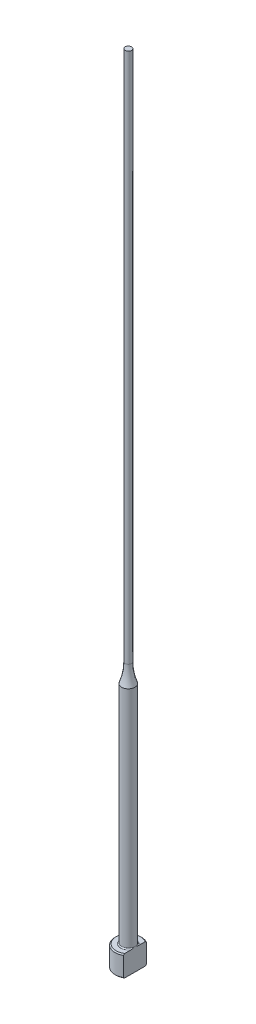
ISO-10303-21;
HEADER;
FILE_DESCRIPTION(('STEP AP214'),'2;1');
FILE_NAME('part.step','',(''),(''),'','','');
FILE_SCHEMA(('AUTOMOTIVE_DESIGN { 1 0 10303 214 1 1 1 1 }'));
ENDSEC;
DATA;
#1=APPLICATION_CONTEXT('core data for automotive mechanical design processes');
#2=APPLICATION_PROTOCOL_DEFINITION('international standard','automotive_design',2000,#1);
#3=PRODUCT_CONTEXT('',#1,'mechanical');
#4=PRODUCT('Part','Part','',(#3));
#5=PRODUCT_RELATED_PRODUCT_CATEGORY('part','',(#4));
#6=PRODUCT_DEFINITION_FORMATION('','',#4);
#7=PRODUCT_DEFINITION_CONTEXT('part definition',#1,'design');
#8=PRODUCT_DEFINITION('design','',#6,#7);
#9=PRODUCT_DEFINITION_SHAPE('','',#8);
#10=(LENGTH_UNIT() NAMED_UNIT(*) SI_UNIT(.MILLI.,.METRE.));
#11=(NAMED_UNIT(*) PLANE_ANGLE_UNIT() SI_UNIT($,.RADIAN.));
#12=(NAMED_UNIT(*) SI_UNIT($,.STERADIAN.) SOLID_ANGLE_UNIT());
#13=UNCERTAINTY_MEASURE_WITH_UNIT(LENGTH_MEASURE(1.E-05),#10,'distance_accuracy_value','');
#14=(GEOMETRIC_REPRESENTATION_CONTEXT(3) GLOBAL_UNCERTAINTY_ASSIGNED_CONTEXT((#13)) GLOBAL_UNIT_ASSIGNED_CONTEXT((#10,
#11,#12)) REPRESENTATION_CONTEXT('',''));
#15=CARTESIAN_POINT('',(0.,0.,0.));
#16=DIRECTION('',(0.,0.,1.));
#17=DIRECTION('',(1.,0.,0.));
#18=AXIS2_PLACEMENT_3D('',#15,#16,#17);
#19=CARTESIAN_POINT('',(-2.49999999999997,4.,0.));
#20=DIRECTION('',(0.,1.,0.));
#21=DIRECTION('',(0.,0.,1.));
#22=AXIS2_PLACEMENT_3D('',#19,#20,#21);
#23=PLANE('',#22);
#24=CARTESIAN_POINT('',(0.,4.,0.));
#25=DIRECTION('',(0.,1.,0.));
#26=DIRECTION('',(0.,0.,1.));
#27=AXIS2_PLACEMENT_3D('',#24,#25,#26);
#28=CIRCLE('',#27,2.29999999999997);
#29=CARTESIAN_POINT('',(1.24999999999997,4.,-1.93067345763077));
#30=VERTEX_POINT('',#29);
#31=CARTESIAN_POINT('',(1.24999999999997,4.,1.93067345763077));
#32=VERTEX_POINT('',#31);
#33=EDGE_CURVE('E187',#30,#32,#28,.T.);
#34=ORIENTED_EDGE('',*,*,#33,.T.);
#35=DIRECTION('',(0.,0.,-1.));
#36=VECTOR('',#35,1.);
#37=CARTESIAN_POINT('',(1.24999999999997,4.,0.));
#38=LINE('',#37,#36);
#39=CARTESIAN_POINT('',(1.24999999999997,3.99999999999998,0.734846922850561));
#40=VERTEX_POINT('',#39);
#41=EDGE_CURVE('E57',#32,#40,#38,.T.);
#42=ORIENTED_EDGE('',*,*,#41,.T.);
#43=CARTESIAN_POINT('',(0.,4.,0.));
#44=DIRECTION('',(0.,1.,0.));
#45=DIRECTION('',(0.,0.,1.));
#46=AXIS2_PLACEMENT_3D('',#43,#44,#45);
#47=CIRCLE('',#46,1.44999999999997);
#48=CARTESIAN_POINT('',(1.24999999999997,3.99999999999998,-0.734846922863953));
#49=VERTEX_POINT('',#48);
#50=EDGE_CURVE('E108',#40,#49,#47,.F.);
#51=ORIENTED_EDGE('',*,*,#50,.T.);
#52=EDGE_CURVE('E137',#49,#30,#38,.T.);
#53=ORIENTED_EDGE('',*,*,#52,.T.);
#54=EDGE_LOOP('',(#34,#42,#51,#53));
#55=FACE_BOUND('',#54,.T.);
#56=ADVANCED_FACE('F32',(#55),#23,.T.);
#57=CARTESIAN_POINT('',(0.,259.958771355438,0.));
#58=DIRECTION('',(0.,1.,0.));
#59=DIRECTION('',(0.,0.,1.));
#60=AXIS2_PLACEMENT_3D('',#57,#58,#59);
#61=CYLINDRICAL_SURFACE('',#60,2.49999999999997);
#62=CARTESIAN_POINT('',(0.,3.80000000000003,0.));
#63=DIRECTION('',(0.,1.,0.));
#64=DIRECTION('',(0.,0.,1.));
#65=AXIS2_PLACEMENT_3D('',#62,#63,#64);
#66=CIRCLE('',#65,2.49999999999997);
#67=CARTESIAN_POINT('',(1.24999999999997,3.80000000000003,2.16506350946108));
#68=VERTEX_POINT('',#67);
#69=CARTESIAN_POINT('',(1.24999999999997,3.80000000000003,-2.16506350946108));
#70=VERTEX_POINT('',#69);
#71=EDGE_CURVE('E105',#68,#70,#66,.F.);
#72=ORIENTED_EDGE('',*,*,#71,.T.);
#73=DIRECTION('',(0.,-1.,0.));
#74=VECTOR('',#73,1.);
#75=CARTESIAN_POINT('',(1.24999999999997,150.,-2.16506350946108));
#76=LINE('',#75,#74);
#77=CARTESIAN_POINT('',(1.24999999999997,0.199999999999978,-2.16506350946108));
#78=VERTEX_POINT('',#77);
#79=EDGE_CURVE('E193',#70,#78,#76,.T.);
#80=ORIENTED_EDGE('',*,*,#79,.T.);
#81=CARTESIAN_POINT('',(0.,0.199999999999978,0.));
#82=DIRECTION('',(0.,-1.,0.));
#83=DIRECTION('',(0.,0.,-1.));
#84=AXIS2_PLACEMENT_3D('',#81,#82,#83);
#85=CIRCLE('',#84,2.49999999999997);
#86=CARTESIAN_POINT('',(1.24999999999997,0.199999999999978,2.16506350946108));
#87=VERTEX_POINT('',#86);
#88=EDGE_CURVE('E100',#78,#87,#85,.F.);
#89=ORIENTED_EDGE('',*,*,#88,.T.);
#90=DIRECTION('',(0.,-1.,0.));
#91=VECTOR('',#90,1.);
#92=CARTESIAN_POINT('',(1.24999999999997,150.,2.16506350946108));
#93=LINE('',#92,#91);
#94=EDGE_CURVE('E93',#68,#87,#93,.T.);
#95=ORIENTED_EDGE('',*,*,#94,.F.);
#96=EDGE_LOOP('',(#72,#80,#89,#95));
#97=FACE_BOUND('',#96,.T.);
#98=ADVANCED_FACE('F158',(#97),#61,.T.);
#99=CARTESIAN_POINT('',(0.,0.,0.));
#100=DIRECTION('',(0.,-1.,0.));
#101=DIRECTION('',(0.,0.,-1.));
#102=AXIS2_PLACEMENT_3D('',#99,#100,#101);
#103=PLANE('',#102);
#104=CARTESIAN_POINT('',(0.,0.,0.));
#105=DIRECTION('',(0.,-1.,0.));
#106=DIRECTION('',(0.,0.,-1.));
#107=AXIS2_PLACEMENT_3D('',#104,#105,#106);
#108=CIRCLE('',#107,2.29999999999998);
#109=CARTESIAN_POINT('',(1.24999999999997,0.,1.93067345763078));
#110=VERTEX_POINT('',#109);
#111=CARTESIAN_POINT('',(1.24999999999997,0.,-1.93067345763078));
#112=VERTEX_POINT('',#111);
#113=EDGE_CURVE('E98',#110,#112,#108,.T.);
#114=ORIENTED_EDGE('',*,*,#113,.T.);
#115=DIRECTION('',(0.,0.,1.));
#116=VECTOR('',#115,1.);
#117=CARTESIAN_POINT('',(1.24999999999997,0.,2.16506350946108));
#118=LINE('',#117,#116);
#119=EDGE_CURVE('E83',#112,#110,#118,.T.);
#120=ORIENTED_EDGE('',*,*,#119,.T.);
#121=EDGE_LOOP('',(#114,#120));
#122=FACE_BOUND('',#121,.T.);
#123=ADVANCED_FACE('F103',(#122),#103,.T.);
#124=CARTESIAN_POINT('',(0.,4.,0.));
#125=DIRECTION('',(0.,-1.,0.));
#126=DIRECTION('',(0.,0.,-1.));
#127=AXIS2_PLACEMENT_3D('',#124,#125,#126);
#128=CONICAL_SURFACE('',#127,2.29999999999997,0.785398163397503);
#129=ORIENTED_EDGE('',*,*,#71,.F.);
#130=CARTESIAN_POINT('',(1.24999999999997,1.37269850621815,4.76610952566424));
#131=CARTESIAN_POINT('',(1.24999999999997,1.47721375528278,4.65805337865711));
#132=CARTESIAN_POINT('',(1.24999999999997,1.5816168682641,4.54988840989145));
#133=CARTESIAN_POINT('',(1.24999999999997,1.79013244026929,4.33327605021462));
#134=CARTESIAN_POINT('',(1.24999999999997,1.89424489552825,4.22482865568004));
#135=CARTESIAN_POINT('',(1.24999999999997,2.10216338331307,4.0075337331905));
#136=CARTESIAN_POINT('',(1.24999999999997,2.20596923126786,3.89868602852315));
#137=CARTESIAN_POINT('',(1.24999999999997,2.4131219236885,3.68055575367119));
#138=CARTESIAN_POINT('',(1.24999999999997,2.51646877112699,3.57127318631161));
#139=CARTESIAN_POINT('',(1.24999999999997,2.72052253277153,3.35432408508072));
#140=CARTESIAN_POINT('',(1.24999999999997,2.82124112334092,3.24666854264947));
#141=CARTESIAN_POINT('',(1.24999999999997,3.02192410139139,3.03065701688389));
#142=CARTESIAN_POINT('',(1.24999999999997,3.12188849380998,2.92230103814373));
#143=CARTESIAN_POINT('',(1.24999999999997,3.32077037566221,2.70467415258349));
#144=CARTESIAN_POINT('',(1.24999999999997,3.41968808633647,2.59540344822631));
#145=CARTESIAN_POINT('',(1.24999999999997,3.61608273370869,2.37557697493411));
#146=CARTESIAN_POINT('',(1.24999999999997,3.71355972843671,2.26502125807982));
#147=CARTESIAN_POINT('',(1.24999999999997,3.86911393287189,2.08515617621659));
#148=CARTESIAN_POINT('',(1.24999999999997,3.9278559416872,2.01642247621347));
#149=CARTESIAN_POINT('',(1.24999999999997,4.04429378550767,1.87806056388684));
#150=CARTESIAN_POINT('',(1.24999999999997,4.1019895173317,1.80843226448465));
#151=CARTESIAN_POINT('',(1.24999999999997,4.21658041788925,1.66728976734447));
#152=CARTESIAN_POINT('',(1.24999999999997,4.27346067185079,1.59576341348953));
#153=CARTESIAN_POINT('',(1.24999999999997,4.38522965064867,1.45118948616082));
#154=CARTESIAN_POINT('',(1.24999999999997,4.44011885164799,1.37814228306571));
#155=CARTESIAN_POINT('',(1.24999999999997,4.54788773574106,1.22886697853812));
#156=CARTESIAN_POINT('',(1.24999999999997,4.60072420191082,1.1526074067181));
#157=CARTESIAN_POINT('',(1.24999999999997,4.70212030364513,0.997098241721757));
#158=CARTESIAN_POINT('',(1.24999999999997,4.75067405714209,0.917844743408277));
#159=CARTESIAN_POINT('',(1.24999999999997,4.84043729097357,0.756494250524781));
#160=CARTESIAN_POINT('',(1.24999999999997,4.88173033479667,0.674444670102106));
#161=CARTESIAN_POINT('',(1.24999999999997,4.95366083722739,0.50583597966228));
#162=CARTESIAN_POINT('',(1.24999999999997,4.98433405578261,0.419293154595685));
#163=CARTESIAN_POINT('',(1.24999999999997,5.01753107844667,0.28950787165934));
#164=CARTESIAN_POINT('',(1.24999999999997,5.02633539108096,0.247870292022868));
#165=CARTESIAN_POINT('',(1.24999999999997,5.03997448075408,0.163937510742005));
#166=CARTESIAN_POINT('',(1.24999999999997,5.04480960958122,0.121642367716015));
#167=CARTESIAN_POINT('',(1.24999999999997,5.05016786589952,0.0369068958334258));
#168=CARTESIAN_POINT('',(1.24999999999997,5.05070431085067,-0.00553257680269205));
#169=CARTESIAN_POINT('',(1.24999999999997,5.04746162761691,-0.0902467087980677));
#170=CARTESIAN_POINT('',(1.24999999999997,5.04368214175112,-0.132521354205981));
#171=CARTESIAN_POINT('',(1.24999999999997,5.03212264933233,-0.216135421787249));
#172=CARTESIAN_POINT('',(1.24999999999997,5.02437758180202,-0.257479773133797));
#173=CARTESIAN_POINT('',(1.24999999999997,5.00536735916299,-0.339354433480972));
#174=CARTESIAN_POINT('',(1.24999999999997,4.99410082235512,-0.379884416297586));
#175=CARTESIAN_POINT('',(1.24999999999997,4.96852211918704,-0.460209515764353));
#176=CARTESIAN_POINT('',(1.24999999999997,4.95419322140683,-0.499999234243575));
#177=CARTESIAN_POINT('',(1.24999999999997,4.92306392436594,-0.578577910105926));
#178=CARTESIAN_POINT('',(1.24999999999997,4.90626403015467,-0.617367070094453));
#179=CARTESIAN_POINT('',(1.24999999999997,4.85269034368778,-0.73271994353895));
#180=CARTESIAN_POINT('',(1.24999999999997,4.81287978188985,-0.807869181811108));
#181=CARTESIAN_POINT('',(1.24999999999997,4.7279921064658,-0.955157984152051));
#182=CARTESIAN_POINT('',(1.24999999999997,4.68290855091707,-1.02729371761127));
#183=CARTESIAN_POINT('',(1.24999999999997,4.58903993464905,-1.16950551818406));
#184=CARTESIAN_POINT('',(1.24999999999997,4.54024093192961,-1.2395723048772));
#185=CARTESIAN_POINT('',(1.24999999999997,4.4402182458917,-1.37788366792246));
#186=CARTESIAN_POINT('',(1.24999999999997,4.38899576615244,-1.44612912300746));
#187=CARTESIAN_POINT('',(1.24999999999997,4.28411092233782,-1.58215279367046));
#188=CARTESIAN_POINT('',(1.24999999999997,4.23042529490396,-1.64991298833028));
#189=CARTESIAN_POINT('',(1.24999999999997,4.12172412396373,-1.78436052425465));
#190=CARTESIAN_POINT('',(1.24999999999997,4.06670849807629,-1.85104779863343));
#191=CARTESIAN_POINT('',(1.24999999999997,3.90044437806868,-2.04954410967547));
#192=CARTESIAN_POINT('',(1.24999999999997,3.78772044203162,-2.18011527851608));
#193=CARTESIAN_POINT('',(1.24999999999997,3.57927088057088,-2.41711311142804));
#194=CARTESIAN_POINT('',(1.24999999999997,3.48391557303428,-2.52386864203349));
#195=CARTESIAN_POINT('',(1.24999999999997,3.2920293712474,-2.73632311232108));
#196=CARTESIAN_POINT('',(1.24999999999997,3.19549844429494,-2.84202202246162));
#197=CARTESIAN_POINT('',(1.24999999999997,2.90446939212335,-3.15815976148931));
#198=CARTESIAN_POINT('',(1.24999999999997,2.70871394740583,-3.36743889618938));
#199=CARTESIAN_POINT('',(1.24999999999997,2.32338273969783,-3.77561196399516));
#200=CARTESIAN_POINT('',(1.24999999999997,2.13388401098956,-3.97457897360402));
#201=CARTESIAN_POINT('',(1.24999999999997,1.84887947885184,-4.27209258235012));
#202=CARTESIAN_POINT('',(1.24999999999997,1.75380504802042,-4.37105278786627));
#203=CARTESIAN_POINT('',(1.24999999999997,1.56341833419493,-4.56874260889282));
#204=CARTESIAN_POINT('',(1.24999999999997,1.46810605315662,-4.66747222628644));
#205=CARTESIAN_POINT('',(1.24999999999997,1.37269850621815,-4.76610952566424));
#206=B_SPLINE_CURVE_WITH_KNOTS('',3,(#130,#131,#132,#133,#134,#135,#136,#137,#138,#139,#140,
#141,#142,#143,#144,#145,#146,#147,#148,#149,#150,#151,#152,#153,#154,#155,#156,#157,#158,#159,
#160,#161,#162,#163,#164,#165,#166,#167,#168,#169,#170,#171,#172,#173,#174,#175,#176,#177,#178,
#179,#180,#181,#182,#183,#184,#185,#186,#187,#188,#189,#190,#191,#192,#193,#194,#195,#196,#197,
#198,#199,#200,#201,#202,#203,#204,#205),.UNSPECIFIED.,.F.,.F.,(4,2,2,2,2,2,2,2,2,2,2,2,2,2,2,2,
2,2,2,2,2,2,2,2,2,2,2,2,2,2,2,2,2,2,2,2,2,4),(0.,0.450994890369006,0.901995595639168,
1.35322763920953,1.80445675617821,2.24672733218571,2.68899501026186,3.13116725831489,
3.57332164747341,3.84456018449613,4.11582532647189,4.3899586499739,4.66402597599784,
4.94225842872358,5.22086725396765,5.49602313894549,5.77024327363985,5.8977564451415,
6.02525831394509,6.15236502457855,6.2794822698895,6.40549833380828,6.5315639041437,
6.65833670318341,6.78508362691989,7.03983854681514,7.29490801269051,7.55098686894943,
7.80693985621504,8.06626716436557,8.32561057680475,8.84304654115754,9.27246240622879,
9.7018902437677,10.5615524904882,11.3858525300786,11.797544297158,12.2092326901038),.UNSPECIFIED.);
#207=EDGE_CURVE('E136',#68,#32,#206,.T.);
#208=ORIENTED_EDGE('',*,*,#207,.T.);
#209=ORIENTED_EDGE('',*,*,#33,.F.);
#210=EDGE_CURVE('E128',#30,#70,#206,.T.);
#211=ORIENTED_EDGE('',*,*,#210,.T.);
#212=EDGE_LOOP('',(#129,#208,#209,#211));
#213=FACE_BOUND('',#212,.T.);
#214=ADVANCED_FACE('F144',(#213),#128,.T.);
#215=CARTESIAN_POINT('',(0.,0.199999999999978,0.));
#216=DIRECTION('',(0.,1.,0.));
#217=DIRECTION('',(0.,0.,1.));
#218=AXIS2_PLACEMENT_3D('',#215,#216,#217);
#219=CONICAL_SURFACE('',#218,2.49999999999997,0.785398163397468);
#220=ORIENTED_EDGE('',*,*,#88,.F.);
#221=CARTESIAN_POINT('',(1.24999999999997,2.62730149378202,-4.76610952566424));
#222=CARTESIAN_POINT('',(1.24999999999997,2.52278624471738,-4.65805337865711));
#223=CARTESIAN_POINT('',(1.24999999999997,2.41838313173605,-4.54988840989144));
#224=CARTESIAN_POINT('',(1.24999999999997,2.20986755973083,-4.3332760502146));
#225=CARTESIAN_POINT('',(1.24999999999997,2.10575510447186,-4.22482865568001));
#226=CARTESIAN_POINT('',(1.24999999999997,1.89783661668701,-4.00753373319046));
#227=CARTESIAN_POINT('',(1.24999999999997,1.79403076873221,-3.89868602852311));
#228=CARTESIAN_POINT('',(1.24999999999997,1.58687807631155,-3.68055575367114));
#229=CARTESIAN_POINT('',(1.24999999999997,1.48353122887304,-3.57127318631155));
#230=CARTESIAN_POINT('',(1.24999999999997,1.27947746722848,-3.35432408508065));
#231=CARTESIAN_POINT('',(1.24999999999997,1.17875887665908,-3.2466685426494));
#232=CARTESIAN_POINT('',(1.24999999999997,0.978075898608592,-3.0306570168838));
#233=CARTESIAN_POINT('',(1.24999999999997,0.878111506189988,-2.92230103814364));
#234=CARTESIAN_POINT('',(1.24999999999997,0.679229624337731,-2.70467415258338));
#235=CARTESIAN_POINT('',(1.24999999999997,0.580311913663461,-2.5954034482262));
#236=CARTESIAN_POINT('',(1.24999999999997,0.383917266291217,-2.375576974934));
#237=CARTESIAN_POINT('',(1.24999999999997,0.286440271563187,-2.2650212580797));
#238=CARTESIAN_POINT('',(1.24999999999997,0.130886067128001,-2.08515617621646));
#239=CARTESIAN_POINT('',(1.24999999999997,0.0721440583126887,-2.01642247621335));
#240=CARTESIAN_POINT('',(1.24999999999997,-0.044293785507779,-1.87806056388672));
#241=CARTESIAN_POINT('',(1.24999999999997,-0.101989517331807,-1.80843226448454));
#242=CARTESIAN_POINT('',(1.24999999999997,-0.216580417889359,-1.66728976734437));
#243=CARTESIAN_POINT('',(1.24999999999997,-0.273460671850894,-1.59576341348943));
#244=CARTESIAN_POINT('',(1.24999999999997,-0.385229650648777,-1.45118948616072));
#245=CARTESIAN_POINT('',(1.24999999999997,-0.440118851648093,-1.37814228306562));
#246=CARTESIAN_POINT('',(1.24999999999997,-0.547887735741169,-1.22886697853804));
#247=CARTESIAN_POINT('',(1.24999999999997,-0.600724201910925,-1.15260740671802));
#248=CARTESIAN_POINT('',(1.24999999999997,-0.702120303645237,-0.997098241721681));
#249=CARTESIAN_POINT('',(1.24999999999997,-0.750674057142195,-0.917844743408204));
#250=CARTESIAN_POINT('',(1.24999999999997,-0.840437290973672,-0.756494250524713));
#251=CARTESIAN_POINT('',(1.24999999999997,-0.88173033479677,-0.67444467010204));
#252=CARTESIAN_POINT('',(1.24999999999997,-0.953660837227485,-0.505835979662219));
#253=CARTESIAN_POINT('',(1.24999999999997,-0.984334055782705,-0.419293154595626));
#254=CARTESIAN_POINT('',(1.24999999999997,-1.01753107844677,-0.289507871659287));
#255=CARTESIAN_POINT('',(1.24999999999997,-1.02633539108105,-0.247870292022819));
#256=CARTESIAN_POINT('',(1.24999999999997,-1.03997448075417,-0.163937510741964));
#257=CARTESIAN_POINT('',(1.24999999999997,-1.0448096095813,-0.121642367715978));
#258=CARTESIAN_POINT('',(1.24999999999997,-1.05016786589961,-0.0369068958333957));
#259=CARTESIAN_POINT('',(1.24999999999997,-1.05070431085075,0.00553257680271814));
#260=CARTESIAN_POINT('',(1.24999999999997,-1.04746162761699,0.0902467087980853));
#261=CARTESIAN_POINT('',(1.24999999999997,-1.0436821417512,0.132521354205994));
#262=CARTESIAN_POINT('',(1.24999999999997,-1.03212264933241,0.216135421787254));
#263=CARTESIAN_POINT('',(1.24999999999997,-1.0243775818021,0.257479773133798));
#264=CARTESIAN_POINT('',(1.24999999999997,-1.00536735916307,0.339354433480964));
#265=CARTESIAN_POINT('',(1.24999999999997,-0.994100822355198,0.379884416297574));
#266=CARTESIAN_POINT('',(1.24999999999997,-0.968522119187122,0.460209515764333));
#267=CARTESIAN_POINT('',(1.24999999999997,-0.954193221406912,0.499999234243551));
#268=CARTESIAN_POINT('',(1.24999999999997,-0.923063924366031,0.578577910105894));
#269=CARTESIAN_POINT('',(1.24999999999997,-0.906264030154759,0.617367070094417));
#270=CARTESIAN_POINT('',(1.24999999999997,-0.852690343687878,0.732719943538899));
#271=CARTESIAN_POINT('',(1.24999999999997,-0.812879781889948,0.807869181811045));
#272=CARTESIAN_POINT('',(1.24999999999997,-0.727992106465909,0.955157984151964));
#273=CARTESIAN_POINT('',(1.24999999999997,-0.682908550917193,1.02729371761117));
#274=CARTESIAN_POINT('',(1.24999999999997,-0.589039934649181,1.16950551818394));
#275=CARTESIAN_POINT('',(1.24999999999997,-0.54024093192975,1.23957230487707));
#276=CARTESIAN_POINT('',(1.24999999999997,-0.440218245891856,1.3778836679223));
#277=CARTESIAN_POINT('',(1.24999999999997,-0.388995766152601,1.44612912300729));
#278=CARTESIAN_POINT('',(1.24999999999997,-0.284110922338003,1.58215279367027));
#279=CARTESIAN_POINT('',(1.24999999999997,-0.230425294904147,1.64991298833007));
#280=CARTESIAN_POINT('',(1.24999999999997,-0.121724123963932,1.78436052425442));
#281=CARTESIAN_POINT('',(1.24999999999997,-0.0667084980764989,1.8510477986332));
#282=CARTESIAN_POINT('',(1.24999999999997,0.0995556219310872,2.0495441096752));
#283=CARTESIAN_POINT('',(1.24999999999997,0.212279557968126,2.18011527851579));
#284=CARTESIAN_POINT('',(1.24999999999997,0.420729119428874,2.41711311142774));
#285=CARTESIAN_POINT('',(1.24999999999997,0.516084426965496,2.5238686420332));
#286=CARTESIAN_POINT('',(1.24999999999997,0.707970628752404,2.73632311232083));
#287=CARTESIAN_POINT('',(1.24999999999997,0.804501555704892,2.84202202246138));
#288=CARTESIAN_POINT('',(1.24999999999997,1.09553060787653,3.15815976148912));
#289=CARTESIAN_POINT('',(1.24999999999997,1.29128605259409,3.36743889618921));
#290=CARTESIAN_POINT('',(1.24999999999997,1.67661726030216,3.77561196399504));
#291=CARTESIAN_POINT('',(1.24999999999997,1.86611598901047,3.97457897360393));
#292=CARTESIAN_POINT('',(1.24999999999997,2.15112052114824,4.27209258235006));
#293=CARTESIAN_POINT('',(1.24999999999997,2.24619495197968,4.37105278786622));
#294=CARTESIAN_POINT('',(1.24999999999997,2.43658166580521,4.5687426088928));
#295=CARTESIAN_POINT('',(1.24999999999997,2.53189394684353,4.66747222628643));
#296=CARTESIAN_POINT('',(1.24999999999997,2.62730149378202,4.76610952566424));
#297=B_SPLINE_CURVE_WITH_KNOTS('',3,(#221,#222,#223,#224,#225,#226,#227,#228,#229,#230,#231,
#232,#233,#234,#235,#236,#237,#238,#239,#240,#241,#242,#243,#244,#245,#246,#247,#248,#249,#250,
#251,#252,#253,#254,#255,#256,#257,#258,#259,#260,#261,#262,#263,#264,#265,#266,#267,#268,#269,
#270,#271,#272,#273,#274,#275,#276,#277,#278,#279,#280,#281,#282,#283,#284,#285,#286,#287,#288,
#289,#290,#291,#292,#293,#294,#295,#296),.UNSPECIFIED.,.F.,.F.,(4,2,2,2,2,2,2,2,2,2,2,2,2,2,2,2,
2,2,2,2,2,2,2,2,2,2,2,2,2,2,2,2,2,2,2,2,2,4),(0.,0.450994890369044,0.901995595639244,
1.35322763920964,1.80445675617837,2.2467273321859,2.68899501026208,3.13116725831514,
3.57332164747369,3.84456018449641,4.11582532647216,4.38995864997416,4.6640259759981,
4.94225842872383,5.22086725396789,5.49602313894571,5.77024327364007,5.89775644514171,
6.02525831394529,6.15236502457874,6.27948226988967,6.40549833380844,6.53156390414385,
6.65833670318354,6.78508362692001,7.03983854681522,7.29490801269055,7.55098686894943,
7.806939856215,8.06626716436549,8.32561057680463,8.84304654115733,9.27246240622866,
9.70189024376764,10.5615524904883,11.3858525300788,11.7975442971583,12.2092326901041),.UNSPECIFIED.);
#298=EDGE_CURVE('E86',#78,#112,#297,.T.);
#299=ORIENTED_EDGE('',*,*,#298,.T.);
#300=ORIENTED_EDGE('',*,*,#113,.F.);
#301=EDGE_CURVE('E89',#110,#87,#297,.T.);
#302=ORIENTED_EDGE('',*,*,#301,.T.);
#303=EDGE_LOOP('',(#220,#299,#300,#302));
#304=FACE_BOUND('',#303,.T.);
#305=ADVANCED_FACE('F97',(#304),#219,.T.);
#306=CARTESIAN_POINT('',(0.,4.19999999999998,0.));
#307=DIRECTION('',(0.,1.,0.));
#308=DIRECTION('',(0.,0.,1.));
#309=AXIS2_PLACEMENT_3D('',#306,#307,#308);
#310=TOROIDAL_SURFACE('',#309,1.44999999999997,0.2);
#311=CARTESIAN_POINT('',(1.24999999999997,4.19999999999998,0.));
#312=CARTESIAN_POINT('',(1.24999999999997,4.20000051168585,-1.97682160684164E-10));
#313=CARTESIAN_POINT('',(1.24999999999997,4.20000102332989,-1.08908071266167E-07));
#314=CARTESIAN_POINT('',(1.24999999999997,4.20000200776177,-4.52594777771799E-07));
#315=CARTESIAN_POINT('',(1.24999999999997,4.20000247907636,-6.9099305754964E-07));
#316=CARTESIAN_POINT('',(1.24999999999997,4.20000341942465,-1.26357946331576E-06));
#317=CARTESIAN_POINT('',(1.24999999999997,4.20000388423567,-1.60457621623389E-06));
#318=CARTESIAN_POINT('',(1.24999999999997,4.20000476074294,-2.33954904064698E-06));
#319=CARTESIAN_POINT('',(1.24999999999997,4.2000051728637,-2.73304152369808E-06));
#320=CARTESIAN_POINT('',(1.24999999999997,4.20000655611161,-4.14544018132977E-06));
#321=CARTESIAN_POINT('',(1.24999999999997,4.20000745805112,-5.23310098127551E-06));
#322=CARTESIAN_POINT('',(1.24999999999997,4.20000906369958,-7.47950368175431E-06));
#323=CARTESIAN_POINT('',(1.24999999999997,4.20000977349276,-8.63414445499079E-06));
#324=CARTESIAN_POINT('',(1.24999999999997,4.20001244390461,-1.31453477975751E-05));
#325=CARTESIAN_POINT('',(1.24999999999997,4.20001426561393,-1.65880556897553E-05));
#326=CARTESIAN_POINT('',(1.24999999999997,4.20001724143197,-2.33729030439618E-05));
#327=CARTESIAN_POINT('',(1.24999999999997,4.20001844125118,-2.66956155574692E-05));
#328=CARTESIAN_POINT('',(1.24999999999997,4.20002354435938,-4.08635087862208E-05));
#329=CARTESIAN_POINT('',(1.24999999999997,4.20002741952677,-5.17114616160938E-05));
#330=CARTESIAN_POINT('',(1.24999999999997,4.20003363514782,-7.2005767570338E-05));
#331=CARTESIAN_POINT('',(1.24999999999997,4.20003612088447,-8.14057067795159E-05));
#332=CARTESIAN_POINT('',(1.24999999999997,4.20005581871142,-0.000149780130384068));
#333=CARTESIAN_POINT('',(1.24999999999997,4.20008094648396,-0.00020612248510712));
#334=CARTESIAN_POINT('',(1.24999999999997,4.20017507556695,-0.000425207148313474));
#335=CARTESIAN_POINT('',(1.24999999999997,4.20023819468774,-0.000589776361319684));
#336=CARTESIAN_POINT('',(1.24999999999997,4.20048692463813,-0.00122878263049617));
#337=CARTESIAN_POINT('',(1.24999999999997,4.20067870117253,-0.00170134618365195));
#338=CARTESIAN_POINT('',(1.24999999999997,4.2014602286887,-0.00363636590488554));
#339=CARTESIAN_POINT('',(1.24999999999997,4.20204298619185,-0.00510090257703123));
#340=CARTESIAN_POINT('',(1.24999999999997,4.20939719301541,-0.0235712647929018));
#341=CARTESIAN_POINT('',(1.24999999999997,4.21621259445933,-0.0405643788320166));
#342=CARTESIAN_POINT('',(1.24999999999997,4.22951000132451,-0.0739606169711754));
#343=CARTESIAN_POINT('',(1.24999999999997,4.23599508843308,-0.0903626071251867));
#344=CARTESIAN_POINT('',(1.24999999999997,4.24961430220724,-0.125111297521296));
#345=CARTESIAN_POINT('',(1.24999999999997,4.2567364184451,-0.1434628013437));
#346=CARTESIAN_POINT('',(1.24999999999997,4.27085039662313,-0.180427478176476));
#347=CARTESIAN_POINT('',(1.24999999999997,4.27784022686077,-0.199041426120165));
#348=CARTESIAN_POINT('',(1.24999999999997,4.29479134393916,-0.245221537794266));
#349=CARTESIAN_POINT('',(1.24999999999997,4.30459026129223,-0.272848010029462));
#350=CARTESIAN_POINT('',(1.24999999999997,4.32310234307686,-0.327738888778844));
#351=CARTESIAN_POINT('',(1.24999999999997,4.3318356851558,-0.354996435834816));
#352=CARTESIAN_POINT('',(1.24999999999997,4.3493656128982,-0.413744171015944));
#353=CARTESIAN_POINT('',(1.24999999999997,4.35799470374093,-0.44528522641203));
#354=CARTESIAN_POINT('',(1.24999999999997,4.37338463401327,-0.50909191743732));
#355=CARTESIAN_POINT('',(1.24999999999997,4.38013036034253,-0.541361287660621));
#356=CARTESIAN_POINT('',(1.24999999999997,4.39136059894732,-0.608339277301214));
#357=CARTESIAN_POINT('',(1.24999999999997,4.39568167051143,-0.643076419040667));
#358=CARTESIAN_POINT('',(1.24999999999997,4.40037605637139,-0.712733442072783));
#359=CARTESIAN_POINT('',(1.24999999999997,4.40076553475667,-0.747651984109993));
#360=CARTESIAN_POINT('',(1.24999999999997,4.39677668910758,-0.808103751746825));
#361=CARTESIAN_POINT('',(1.24999999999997,4.39361441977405,-0.833711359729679));
#362=CARTESIAN_POINT('',(1.24999999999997,4.38355990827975,-0.883915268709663));
#363=CARTESIAN_POINT('',(1.24999999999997,4.37671813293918,-0.908520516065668));
#364=CARTESIAN_POINT('',(1.24999999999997,4.36252570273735,-0.944879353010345));
#365=CARTESIAN_POINT('',(1.24999999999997,4.35688428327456,-0.957298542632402));
#366=CARTESIAN_POINT('',(1.24999999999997,4.34399066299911,-0.981318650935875));
#367=CARTESIAN_POINT('',(1.24999999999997,4.33673636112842,-0.992918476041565));
#368=CARTESIAN_POINT('',(1.24999999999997,4.32199744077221,-1.01267533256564));
#369=CARTESIAN_POINT('',(1.24999999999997,4.31482723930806,-1.02106482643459));
#370=CARTESIAN_POINT('',(1.24999999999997,4.29924321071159,-1.03659690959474));
#371=CARTESIAN_POINT('',(1.24999999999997,4.29083198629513,-1.04374204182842));
#372=CARTESIAN_POINT('',(1.24999999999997,4.27498600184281,-1.05478694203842));
#373=CARTESIAN_POINT('',(1.24999999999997,4.26780814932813,-1.059053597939));
#374=CARTESIAN_POINT('',(1.24999999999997,4.25284782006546,-1.06635953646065));
#375=CARTESIAN_POINT('',(1.24999999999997,4.24506572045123,-1.06939957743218));
#376=CARTESIAN_POINT('',(1.24999999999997,4.22901828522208,-1.07404931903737));
#377=CARTESIAN_POINT('',(1.24999999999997,4.22074990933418,-1.07564870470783));
#378=CARTESIAN_POINT('',(1.24999999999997,4.20405985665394,-1.07723717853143));
#379=CARTESIAN_POINT('',(1.24999999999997,4.19563825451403,-1.07722703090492));
#380=CARTESIAN_POINT('',(1.24999999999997,4.17988128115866,-1.07569157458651));
#381=CARTESIAN_POINT('',(1.24999999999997,4.17252879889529,-1.0743339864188));
#382=CARTESIAN_POINT('',(1.24999999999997,4.15814333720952,-1.07044616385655));
#383=CARTESIAN_POINT('',(1.24999999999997,4.15111040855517,-1.06791574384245));
#384=CARTESIAN_POINT('',(1.24999999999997,4.13724955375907,-1.06171920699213));
#385=CARTESIAN_POINT('',(1.24999999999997,4.13043935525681,-1.05801386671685));
#386=CARTESIAN_POINT('',(1.24999999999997,4.11740316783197,-1.04969609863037));
#387=CARTESIAN_POINT('',(1.24999999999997,4.11117742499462,-1.04508329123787));
#388=CARTESIAN_POINT('',(1.24999999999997,4.0958619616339,-1.03220341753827));
#389=CARTESIAN_POINT('',(1.24999999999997,4.08723799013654,-1.02338140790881));
#390=CARTESIAN_POINT('',(1.24999999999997,4.07148817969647,-1.00448021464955));
#391=CARTESIAN_POINT('',(1.24999999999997,4.06436716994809,-0.994397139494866));
#392=CARTESIAN_POINT('',(1.24999999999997,4.04800089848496,-0.96769446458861));
#393=CARTESIAN_POINT('',(1.24999999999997,4.0397014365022,-0.950498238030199));
#394=CARTESIAN_POINT('',(1.24999999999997,4.02582422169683,-0.915117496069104));
#395=CARTESIAN_POINT('',(1.24999999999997,4.02024415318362,-0.89693383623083));
#396=CARTESIAN_POINT('',(1.24999999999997,4.00805724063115,-0.846781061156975));
#397=CARTESIAN_POINT('',(1.24999999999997,4.00359525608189,-0.814297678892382));
#398=CARTESIAN_POINT('',(1.24999999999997,3.99933348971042,-0.748574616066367));
#399=CARTESIAN_POINT('',(1.24999999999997,3.99961552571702,-0.71533156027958));
#400=CARTESIAN_POINT('',(1.24999999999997,4.00446632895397,-0.637920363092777));
#401=CARTESIAN_POINT('',(1.24999999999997,4.0104488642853,-0.593849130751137));
#402=CARTESIAN_POINT('',(1.24999999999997,4.02681929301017,-0.50640159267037));
#403=CARTESIAN_POINT('',(1.24999999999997,4.03722697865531,-0.463029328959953));
#404=CARTESIAN_POINT('',(1.24999999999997,4.060071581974,-0.380638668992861));
#405=CARTESIAN_POINT('',(1.24999999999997,4.07227412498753,-0.34155342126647));
#406=CARTESIAN_POINT('',(1.24999999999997,4.09824323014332,-0.264347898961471));
#407=CARTESIAN_POINT('',(1.24999999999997,4.11199311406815,-0.226221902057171));
#408=CARTESIAN_POINT('',(1.24999999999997,4.13108825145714,-0.175350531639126));
#409=CARTESIAN_POINT('',(1.24999999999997,4.13599999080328,-0.162438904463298));
#410=CARTESIAN_POINT('',(1.24999999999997,4.14604281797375,-0.136318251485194));
#411=CARTESIAN_POINT('',(1.24999999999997,4.15117629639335,-0.123110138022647));
#412=CARTESIAN_POINT('',(1.24999999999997,4.16341702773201,-0.0918425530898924));
#413=CARTESIAN_POINT('',(1.24999999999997,4.17055250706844,-0.0737943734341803));
#414=CARTESIAN_POINT('',(1.24999999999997,4.18426943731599,-0.0393586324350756));
#415=CARTESIAN_POINT('',(1.24999999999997,4.19084281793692,-0.0229681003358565));
#416=CARTESIAN_POINT('',(1.24999999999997,4.19795564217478,-0.00510438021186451));
#417=CARTESIAN_POINT('',(1.24999999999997,4.19853702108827,-0.00364331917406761));
#418=CARTESIAN_POINT('',(1.24999999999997,4.19931818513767,-0.00170914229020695));
#419=CARTESIAN_POINT('',(1.24999999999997,4.19951102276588,-0.00123396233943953));
#420=CARTESIAN_POINT('',(1.24999999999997,4.19976104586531,-0.000591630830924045));
#421=CARTESIAN_POINT('',(1.24999999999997,4.19982443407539,-0.000426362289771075));
#422=CARTESIAN_POINT('',(1.24999999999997,4.19991892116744,-0.000206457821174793));
#423=CARTESIAN_POINT('',(1.24999999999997,4.19994410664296,-0.000149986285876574));
#424=CARTESIAN_POINT('',(1.24999999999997,4.19996383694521,-8.14647488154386E-05));
#425=CARTESIAN_POINT('',(1.24999999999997,4.19996632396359,-7.20551568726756E-05));
#426=CARTESIAN_POINT('',(1.24999999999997,4.19997254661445,-5.17396177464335E-05));
#427=CARTESIAN_POINT('',(1.24999999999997,4.19997642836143,-4.08803463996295E-05));
#428=CARTESIAN_POINT('',(1.24999999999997,4.19998153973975,-2.66997573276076E-05));
#429=CARTESIAN_POINT('',(1.24999999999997,4.19998274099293,-2.33755457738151E-05));
#430=CARTESIAN_POINT('',(1.24999999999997,4.1999857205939,-1.65878758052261E-05));
#431=CARTESIAN_POINT('',(1.24999999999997,4.19998754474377,-1.31438994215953E-05));
#432=CARTESIAN_POINT('',(1.24999999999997,4.19999021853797,-8.63150511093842E-06));
#433=CARTESIAN_POINT('',(1.24999999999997,4.19999092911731,-7.47674880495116E-06));
#434=CARTESIAN_POINT('',(1.24999999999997,4.19999253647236,-5.23027080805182E-06));
#435=CARTESIAN_POINT('',(1.24999999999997,4.19999343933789,-4.14265821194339E-06));
#436=CARTESIAN_POINT('',(1.24999999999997,4.19999482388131,-2.73051190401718E-06));
#437=CARTESIAN_POINT('',(1.24999999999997,4.19999523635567,-2.33712918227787E-06));
#438=CARTESIAN_POINT('',(1.24999999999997,4.1999961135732,-1.60243917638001E-06));
#439=CARTESIAN_POINT('',(1.24999999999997,4.19999657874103,-1.26161620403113E-06));
#440=CARTESIAN_POINT('',(1.24999999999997,4.19999751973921,-6.89449589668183E-07));
#441=CARTESIAN_POINT('',(1.24999999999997,4.1999979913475,-4.51288695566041E-07));
#442=CARTESIAN_POINT('',(1.24999999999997,4.19999897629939,-1.08178106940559E-07));
#443=CARTESIAN_POINT('',(1.24999999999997,4.19999948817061,1.97737602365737E-10));
#444=CARTESIAN_POINT('',(1.24999999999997,4.19999999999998,0.));
#445=B_SPLINE_CURVE_WITH_KNOTS('',3,(#311,#312,#313,#314,#315,#316,#317,#318,#319,#320,#321,
#322,#323,#324,#325,#326,#327,#328,#329,#330,#331,#332,#333,#334,#335,#336,#337,#338,#339,#340,
#341,#342,#343,#344,#345,#346,#347,#348,#349,#350,#351,#352,#353,#354,#355,#356,#357,#358,#359,
#360,#361,#362,#363,#364,#365,#366,#367,#368,#369,#370,#371,#372,#373,#374,#375,#376,#377,#378,
#379,#380,#381,#382,#383,#384,#385,#386,#387,#388,#389,#390,#391,#392,#393,#394,#395,#396,#397,
#398,#399,#400,#401,#402,#403,#404,#405,#406,#407,#408,#409,#410,#411,#412,#413,#414,#415,#416,
#417,#418,#419,#420,#421,#422,#423,#424,#425,#426,#427,#428,#429,#430,#431,#432,#433,#434,#435,
#436,#437,#438,#439,#440,#441,#442,#443,#444),.UNSPECIFIED.,.T.,.F.,(4,2,2,2,2,2,2,2,2,2,2,2,2,
2,2,2,2,2,2,2,2,2,2,2,2,2,2,2,2,2,2,2,2,2,2,2,2,2,2,2,2,2,2,2,2,2,2,2,2,2,2,2,2,2,2,2,2,2,2,2,2,
2,2,2,2,2,4),(0.,1.53427571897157E-06,3.11115051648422E-06,4.83351630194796E-06,
6.54098938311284E-06,1.07594292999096E-05,1.48222850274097E-05,2.64707312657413E-05,
3.70576286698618E-05,7.16088725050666E-05,0.000100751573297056,0.000285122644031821,
0.00081447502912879,0.00234373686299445,0.00707317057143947,0.0619940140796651,
0.114907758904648,0.17396170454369,0.233609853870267,0.321537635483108,0.40738870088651,
0.505443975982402,0.604264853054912,0.709126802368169,0.813557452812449,0.890773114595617,
0.966955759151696,1.00778845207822,1.04867465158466,1.08167318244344,1.11460346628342,
1.13955805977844,1.16449720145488,1.1896135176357,1.2147179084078,1.23704542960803,
1.25937648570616,1.28254952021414,1.30573226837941,1.34253218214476,1.37944859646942,
1.43640829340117,1.49331940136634,1.59113685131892,1.69064301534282,1.82371118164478,
1.9573808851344,2.08016146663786,2.20172662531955,2.2431696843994,2.28568093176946,
2.34390494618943,2.39687801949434,2.40159623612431,2.40313396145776,2.40366556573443,
2.40385035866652,2.40387953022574,2.403914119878,2.40392471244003,2.403936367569,
2.4039404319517,2.40394465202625,2.40394636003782,2.403948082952,2.40394966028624,
2.40395119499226),.UNSPECIFIED.);
#446=CARTESIAN_POINT('',(1.24999999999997,4.19999999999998,0.));
#447=VERTEX_POINT('',#446);
#448=EDGE_CURVE('E11',#49,#447,#445,.T.);
#449=ORIENTED_EDGE('',*,*,#448,.F.);
#450=ORIENTED_EDGE('',*,*,#50,.F.);
#451=CARTESIAN_POINT('',(1.24999999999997,4.19999999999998,0.));
#452=CARTESIAN_POINT('',(1.24999999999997,4.19999948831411,1.9768217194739E-10));
#453=CARTESIAN_POINT('',(1.24999999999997,4.19999897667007,1.08908071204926E-07));
#454=CARTESIAN_POINT('',(1.24999999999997,4.19999799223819,4.52594777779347E-07));
#455=CARTESIAN_POINT('',(1.24999999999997,4.19999752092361,6.9099305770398E-07));
#456=CARTESIAN_POINT('',(1.24999999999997,4.19999658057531,1.26357946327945E-06));
#457=CARTESIAN_POINT('',(1.24999999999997,4.19999611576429,1.6045762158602E-06));
#458=CARTESIAN_POINT('',(1.24999999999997,4.19999523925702,2.33954904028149E-06));
#459=CARTESIAN_POINT('',(1.24999999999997,4.19999482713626,2.73304152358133E-06));
#460=CARTESIAN_POINT('',(1.24999999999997,4.19999344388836,4.14544018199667E-06));
#461=CARTESIAN_POINT('',(1.24999999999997,4.19999254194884,5.23310098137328E-06));
#462=CARTESIAN_POINT('',(1.24999999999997,4.19999093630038,7.47950368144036E-06));
#463=CARTESIAN_POINT('',(1.24999999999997,4.19999022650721,8.63414445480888E-06));
#464=CARTESIAN_POINT('',(1.24999999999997,4.19998755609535,1.31453477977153E-05));
#465=CARTESIAN_POINT('',(1.24999999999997,4.19998573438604,1.65880556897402E-05));
#466=CARTESIAN_POINT('',(1.24999999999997,4.19998275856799,2.33729030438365E-05));
#467=CARTESIAN_POINT('',(1.24999999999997,4.19998155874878,2.66956155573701E-05));
#468=CARTESIAN_POINT('',(1.24999999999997,4.19997645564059,4.0863508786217E-05));
#469=CARTESIAN_POINT('',(1.24999999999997,4.1999725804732,5.17114616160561E-05));
#470=CARTESIAN_POINT('',(1.24999999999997,4.19996636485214,7.20057675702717E-05));
#471=CARTESIAN_POINT('',(1.24999999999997,4.19996387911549,8.1405706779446E-05));
#472=CARTESIAN_POINT('',(1.24999999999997,4.19994418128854,0.000149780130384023));
#473=CARTESIAN_POINT('',(1.24999999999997,4.199919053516,0.000206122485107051));
#474=CARTESIAN_POINT('',(1.24999999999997,4.19982492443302,0.000425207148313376));
#475=CARTESIAN_POINT('',(1.24999999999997,4.19976180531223,0.000589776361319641));
#476=CARTESIAN_POINT('',(1.24999999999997,4.19951307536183,0.00122878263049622));
#477=CARTESIAN_POINT('',(1.24999999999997,4.19932129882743,0.00170134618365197));
#478=CARTESIAN_POINT('',(1.24999999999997,4.19853977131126,0.00363636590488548));
#479=CARTESIAN_POINT('',(1.24999999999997,4.19795701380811,0.0051009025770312));
#480=CARTESIAN_POINT('',(1.24999999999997,4.19060280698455,0.0235712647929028));
#481=CARTESIAN_POINT('',(1.24999999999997,4.18378740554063,0.0405643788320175));
#482=CARTESIAN_POINT('',(1.24999999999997,4.17048999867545,0.073960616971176));
#483=CARTESIAN_POINT('',(1.24999999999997,4.16400491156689,0.0903626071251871));
#484=CARTESIAN_POINT('',(1.24999999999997,4.15038569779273,0.125111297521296));
#485=CARTESIAN_POINT('',(1.24999999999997,4.14326358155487,0.1434628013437));
#486=CARTESIAN_POINT('',(1.24999999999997,4.12914960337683,0.180427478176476));
#487=CARTESIAN_POINT('',(1.24999999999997,4.12215977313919,0.199041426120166));
#488=CARTESIAN_POINT('',(1.24999999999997,4.1052086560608,0.245221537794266));
#489=CARTESIAN_POINT('',(1.24999999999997,4.09540973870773,0.272848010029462));
#490=CARTESIAN_POINT('',(1.24999999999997,4.0768976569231,0.327738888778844));
#491=CARTESIAN_POINT('',(1.24999999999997,4.06816431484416,0.354996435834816));
#492=CARTESIAN_POINT('',(1.24999999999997,4.05063438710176,0.413744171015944));
#493=CARTESIAN_POINT('',(1.24999999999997,4.04200529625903,0.44528522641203));
#494=CARTESIAN_POINT('',(1.24999999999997,4.0266153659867,0.50909191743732));
#495=CARTESIAN_POINT('',(1.24999999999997,4.01986963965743,0.541361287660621));
#496=CARTESIAN_POINT('',(1.24999999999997,4.00863940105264,0.608339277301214));
#497=CARTESIAN_POINT('',(1.24999999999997,4.00431832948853,0.643076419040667));
#498=CARTESIAN_POINT('',(1.24999999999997,3.99962394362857,0.712733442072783));
#499=CARTESIAN_POINT('',(1.24999999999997,3.99923446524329,0.747651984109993));
#500=CARTESIAN_POINT('',(1.24999999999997,4.00322331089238,0.808103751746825));
#501=CARTESIAN_POINT('',(1.24999999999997,4.00638558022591,0.833711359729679));
#502=CARTESIAN_POINT('',(1.24999999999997,4.01644009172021,0.883915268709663));
#503=CARTESIAN_POINT('',(1.24999999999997,4.02328186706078,0.908520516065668));
#504=CARTESIAN_POINT('',(1.24999999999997,4.03747429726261,0.944879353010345));
#505=CARTESIAN_POINT('',(1.24999999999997,4.0431157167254,0.957298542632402));
#506=CARTESIAN_POINT('',(1.24999999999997,4.05600933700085,0.981318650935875));
#507=CARTESIAN_POINT('',(1.24999999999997,4.06326363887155,0.992918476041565));
#508=CARTESIAN_POINT('',(1.24999999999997,4.07800255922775,1.01267533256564));
#509=CARTESIAN_POINT('',(1.24999999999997,4.08517276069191,1.02106482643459));
#510=CARTESIAN_POINT('',(1.24999999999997,4.10075678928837,1.03659690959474));
#511=CARTESIAN_POINT('',(1.24999999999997,4.10916801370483,1.04374204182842));
#512=CARTESIAN_POINT('',(1.24999999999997,4.12501399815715,1.05478694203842));
#513=CARTESIAN_POINT('',(1.24999999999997,4.13219185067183,1.059053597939));
#514=CARTESIAN_POINT('',(1.24999999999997,4.1471521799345,1.06635953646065));
#515=CARTESIAN_POINT('',(1.24999999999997,4.15493427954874,1.06939957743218));
#516=CARTESIAN_POINT('',(1.24999999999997,4.17098171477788,1.07404931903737));
#517=CARTESIAN_POINT('',(1.24999999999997,4.17925009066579,1.07564870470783));
#518=CARTESIAN_POINT('',(1.24999999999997,4.19594014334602,1.07723717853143));
#519=CARTESIAN_POINT('',(1.24999999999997,4.20436174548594,1.07722703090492));
#520=CARTESIAN_POINT('',(1.24999999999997,4.2201187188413,1.07569157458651));
#521=CARTESIAN_POINT('',(1.24999999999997,4.22747120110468,1.0743339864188));
#522=CARTESIAN_POINT('',(1.24999999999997,4.24185666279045,1.07044616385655));
#523=CARTESIAN_POINT('',(1.24999999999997,4.2488895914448,1.06791574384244));
#524=CARTESIAN_POINT('',(1.24999999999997,4.2627504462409,1.06171920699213));
#525=CARTESIAN_POINT('',(1.24999999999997,4.26956064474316,1.05801386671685));
#526=CARTESIAN_POINT('',(1.24999999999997,4.28259683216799,1.04969609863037));
#527=CARTESIAN_POINT('',(1.24999999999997,4.28882257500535,1.04508329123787));
#528=CARTESIAN_POINT('',(1.24999999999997,4.30413803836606,1.03220341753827));
#529=CARTESIAN_POINT('',(1.24999999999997,4.31276200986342,1.02338140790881));
#530=CARTESIAN_POINT('',(1.24999999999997,4.32851182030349,1.00448021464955));
#531=CARTESIAN_POINT('',(1.24999999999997,4.33563283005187,0.994397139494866));
#532=CARTESIAN_POINT('',(1.24999999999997,4.351999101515,0.96769446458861));
#533=CARTESIAN_POINT('',(1.24999999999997,4.36029856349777,0.9504982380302));
#534=CARTESIAN_POINT('',(1.24999999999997,4.37417577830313,0.915117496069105));
#535=CARTESIAN_POINT('',(1.24999999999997,4.37975584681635,0.89693383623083));
#536=CARTESIAN_POINT('',(1.24999999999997,4.39194275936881,0.846781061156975));
#537=CARTESIAN_POINT('',(1.24999999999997,4.39640474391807,0.814297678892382));
#538=CARTESIAN_POINT('',(1.24999999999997,4.40066651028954,0.748574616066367));
#539=CARTESIAN_POINT('',(1.24999999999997,4.40038447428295,0.71533156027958));
#540=CARTESIAN_POINT('',(1.24999999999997,4.39553367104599,0.637920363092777));
#541=CARTESIAN_POINT('',(1.24999999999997,4.38955113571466,0.593849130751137));
#542=CARTESIAN_POINT('',(1.24999999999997,4.37318070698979,0.50640159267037));
#543=CARTESIAN_POINT('',(1.24999999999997,4.36277302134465,0.463029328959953));
#544=CARTESIAN_POINT('',(1.24999999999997,4.33992841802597,0.380638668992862));
#545=CARTESIAN_POINT('',(1.24999999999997,4.32772587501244,0.34155342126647));
#546=CARTESIAN_POINT('',(1.24999999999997,4.30175676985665,0.264347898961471));
#547=CARTESIAN_POINT('',(1.24999999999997,4.28800688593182,0.226221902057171));
#548=CARTESIAN_POINT('',(1.24999999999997,4.26891174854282,0.175350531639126));
#549=CARTESIAN_POINT('',(1.24999999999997,4.26400000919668,0.162438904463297));
#550=CARTESIAN_POINT('',(1.24999999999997,4.25395718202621,0.136318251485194));
#551=CARTESIAN_POINT('',(1.24999999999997,4.24882370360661,0.123110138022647));
#552=CARTESIAN_POINT('',(1.24999999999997,4.23658297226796,0.0918425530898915));
#553=CARTESIAN_POINT('',(1.24999999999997,4.22944749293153,0.0737943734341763));
#554=CARTESIAN_POINT('',(1.24999999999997,4.21573056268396,0.0393586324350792));
#555=CARTESIAN_POINT('',(1.24999999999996,4.209157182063,0.0229681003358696));
#556=CARTESIAN_POINT('',(1.24999999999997,4.20204435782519,0.00510438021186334));
#557=CARTESIAN_POINT('',(1.24999999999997,4.2014629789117,0.0036433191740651));
#558=CARTESIAN_POINT('',(1.24999999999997,4.20068181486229,0.00170914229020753));
#559=CARTESIAN_POINT('',(1.24999999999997,4.20048897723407,0.00123396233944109));
#560=CARTESIAN_POINT('',(1.24999999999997,4.20023895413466,0.00059163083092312));
#561=CARTESIAN_POINT('',(1.24999999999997,4.20017556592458,0.000426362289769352));
#562=CARTESIAN_POINT('',(1.24999999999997,4.20008107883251,0.000206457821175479));
#563=CARTESIAN_POINT('',(1.24999999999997,4.20005589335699,0.000149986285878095));
#564=CARTESIAN_POINT('',(1.24999999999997,4.20003616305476,8.14647488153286E-05));
#565=CARTESIAN_POINT('',(1.24999999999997,4.20003367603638,7.2055156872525E-05));
#566=CARTESIAN_POINT('',(1.24999999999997,4.20002745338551,5.17396177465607E-05));
#567=CARTESIAN_POINT('',(1.24999999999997,4.20002357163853,4.08803464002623E-05));
#568=CARTESIAN_POINT('',(1.24999999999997,4.20001846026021,2.66997573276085E-05));
#569=CARTESIAN_POINT('',(1.24999999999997,4.20001725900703,2.33755457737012E-05));
#570=CARTESIAN_POINT('',(1.24999999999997,4.20001427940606,1.65878758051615E-05));
#571=CARTESIAN_POINT('',(1.24999999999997,4.20001245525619,1.314389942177E-05));
#572=CARTESIAN_POINT('',(1.24999999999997,4.20000978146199,8.63150511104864E-06));
#573=CARTESIAN_POINT('',(1.24999999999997,4.20000907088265,7.47674880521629E-06));
#574=CARTESIAN_POINT('',(1.24999999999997,4.2000074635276,5.23027080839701E-06));
#575=CARTESIAN_POINT('',(1.24999999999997,4.20000656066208,4.14265821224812E-06));
#576=CARTESIAN_POINT('',(1.24999999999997,4.20000517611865,2.73051190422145E-06));
#577=CARTESIAN_POINT('',(1.24999999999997,4.20000476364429,2.33712918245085E-06));
#578=CARTESIAN_POINT('',(1.24999999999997,4.20000388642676,1.60243917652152E-06));
#579=CARTESIAN_POINT('',(1.24999999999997,4.20000342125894,1.2616162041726E-06));
#580=CARTESIAN_POINT('',(1.24999999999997,4.20000248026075,6.89449589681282E-07));
#581=CARTESIAN_POINT('',(1.24999999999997,4.20000200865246,4.51288695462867E-07));
#582=CARTESIAN_POINT('',(1.24999999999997,4.20000102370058,1.08178106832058E-07));
#583=CARTESIAN_POINT('',(1.24999999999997,4.20000051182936,-1.97737613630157E-10));
#584=CARTESIAN_POINT('',(1.24999999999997,4.19999999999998,0.));
#585=B_SPLINE_CURVE_WITH_KNOTS('',3,(#451,#452,#453,#454,#455,#456,#457,#458,#459,#460,#461,
#462,#463,#464,#465,#466,#467,#468,#469,#470,#471,#472,#473,#474,#475,#476,#477,#478,#479,#480,
#481,#482,#483,#484,#485,#486,#487,#488,#489,#490,#491,#492,#493,#494,#495,#496,#497,#498,#499,
#500,#501,#502,#503,#504,#505,#506,#507,#508,#509,#510,#511,#512,#513,#514,#515,#516,#517,#518,
#519,#520,#521,#522,#523,#524,#525,#526,#527,#528,#529,#530,#531,#532,#533,#534,#535,#536,#537,
#538,#539,#540,#541,#542,#543,#544,#545,#546,#547,#548,#549,#550,#551,#552,#553,#554,#555,#556,
#557,#558,#559,#560,#561,#562,#563,#564,#565,#566,#567,#568,#569,#570,#571,#572,#573,#574,#575,
#576,#577,#578,#579,#580,#581,#582,#583,#584),.UNSPECIFIED.,.T.,.F.,(4,2,2,2,2,2,2,2,2,2,2,2,2,
2,2,2,2,2,2,2,2,2,2,2,2,2,2,2,2,2,2,2,2,2,2,2,2,2,2,2,2,2,2,2,2,2,2,2,2,2,2,2,2,2,2,2,2,2,2,2,2,
2,2,2,2,2,4),(0.,1.53427571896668E-06,3.11115051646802E-06,4.83351630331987E-06,
6.5409893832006E-06,1.07594292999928E-05,1.4822285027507E-05,2.64707312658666E-05,
3.7057628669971E-05,7.1608872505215E-05,0.000100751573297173,0.00028512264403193,
0.000814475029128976,0.00234373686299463,0.00707317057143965,0.0619940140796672,
0.114907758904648,0.173961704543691,0.233609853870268,0.321537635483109,0.40738870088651,
0.505443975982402,0.604264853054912,0.709126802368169,0.813557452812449,0.890773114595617,
0.966955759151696,1.00778845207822,1.04867465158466,1.08167318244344,1.11460346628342,
1.13955805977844,1.16449720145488,1.1896135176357,1.2147179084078,1.23704542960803,
1.25937648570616,1.28254952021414,1.30573226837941,1.34253218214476,1.37944859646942,
1.43640829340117,1.49331940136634,1.59113685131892,1.69064301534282,1.82371118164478,
1.9573808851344,2.08016146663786,2.20172662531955,2.2431696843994,2.28568093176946,
2.34390494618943,2.39687801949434,2.40159623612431,2.40313396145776,2.40366556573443,
2.40385035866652,2.40387953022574,2.403914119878,2.40392471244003,2.403936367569,
2.4039404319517,2.40394465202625,2.40394636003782,2.40394808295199,2.40394966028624,
2.40395119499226),.UNSPECIFIED.);
#586=EDGE_CURVE('E46',#447,#40,#585,.T.);
#587=ORIENTED_EDGE('',*,*,#586,.F.);
#588=CARTESIAN_POINT('',(0.,4.19999999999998,0.));
#589=DIRECTION('',(0.,1.,0.));
#590=DIRECTION('',(0.,0.,1.));
#591=AXIS2_PLACEMENT_3D('',#588,#589,#590);
#592=CIRCLE('',#591,1.24999999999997);
#593=EDGE_CURVE('E104',#447,#447,#592,.T.);
#594=ORIENTED_EDGE('',*,*,#593,.F.);
#595=EDGE_LOOP('',(#449,#450,#587,#594));
#596=FACE_BOUND('',#595,.T.);
#597=ADVANCED_FACE('F34',(#596),#310,.F.);
#598=CARTESIAN_POINT('',(-0.599999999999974,150.,0.));
#599=DIRECTION('',(0.,1.,0.));
#600=DIRECTION('',(0.,0.,1.));
#601=AXIS2_PLACEMENT_3D('',#598,#599,#600);
#602=PLANE('',#601);
#603=CARTESIAN_POINT('',(0.,150.,0.));
#604=DIRECTION('',(0.,1.,0.));
#605=DIRECTION('',(0.,0.,1.));
#606=AXIS2_PLACEMENT_3D('',#603,#604,#605);
#607=CIRCLE('',#606,0.599999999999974);
#608=CARTESIAN_POINT('',(0.,150.,0.599999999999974));
#609=VERTEX_POINT('',#608);
#610=EDGE_CURVE('E186',#609,#609,#607,.T.);
#611=ORIENTED_EDGE('',*,*,#610,.T.);
#612=EDGE_LOOP('',(#611));
#613=FACE_BOUND('',#612,.T.);
#614=ADVANCED_FACE('F149',(#613),#602,.T.);
#615=CARTESIAN_POINT('',(0.,259.958771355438,0.));
#616=DIRECTION('',(0.,1.,0.));
#617=DIRECTION('',(0.,0.,1.));
#618=AXIS2_PLACEMENT_3D('',#615,#616,#617);
#619=CYLINDRICAL_SURFACE('',#618,0.599999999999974);
#620=CARTESIAN_POINT('',(0.,50.,0.));
#621=DIRECTION('',(0.,1.,0.));
#622=DIRECTION('',(0.,0.,1.));
#623=AXIS2_PLACEMENT_3D('',#620,#621,#622);
#624=CIRCLE('',#623,0.599999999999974);
#625=CARTESIAN_POINT('',(0.,50.,0.599999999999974));
#626=VERTEX_POINT('',#625);
#627=EDGE_CURVE('E183',#626,#626,#624,.T.);
#628=ORIENTED_EDGE('',*,*,#627,.T.);
#629=EDGE_LOOP('',(#628));
#630=FACE_BOUND('',#629,.T.);
#631=ORIENTED_EDGE('',*,*,#610,.F.);
#632=EDGE_LOOP('',(#631));
#633=FACE_BOUND('',#632,.T.);
#634=ADVANCED_FACE('F172',(#630,#633),#619,.T.);
#635=CARTESIAN_POINT('',(0.,50.,0.));
#636=DIRECTION('',(0.,1.,0.));
#637=DIRECTION('',(0.,0.,1.));
#638=AXIS2_PLACEMENT_3D('',#635,#636,#637);
#639=TOROIDAL_SURFACE('',#638,10.6,10.);
#640=CARTESIAN_POINT('',(0.,46.4535228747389,0.));
#641=DIRECTION('',(0.,1.,0.));
#642=DIRECTION('',(0.,0.,1.));
#643=AXIS2_PLACEMENT_3D('',#640,#641,#642);
#644=CIRCLE('',#643,1.24999999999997);
#645=CARTESIAN_POINT('',(0.,46.4535228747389,1.24999999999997));
#646=VERTEX_POINT('',#645);
#647=EDGE_CURVE('E101',#646,#646,#644,.T.);
#648=ORIENTED_EDGE('',*,*,#647,.T.);
#649=EDGE_LOOP('',(#648));
#650=FACE_BOUND('',#649,.T.);
#651=ORIENTED_EDGE('',*,*,#627,.F.);
#652=EDGE_LOOP('',(#651));
#653=FACE_BOUND('',#652,.T.);
#654=ADVANCED_FACE('F169',(#650,#653),#639,.F.);
#655=CARTESIAN_POINT('',(0.,259.958771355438,0.));
#656=DIRECTION('',(0.,1.,0.));
#657=DIRECTION('',(0.,0.,1.));
#658=AXIS2_PLACEMENT_3D('',#655,#656,#657);
#659=CYLINDRICAL_SURFACE('',#658,1.24999999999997);
#660=ORIENTED_EDGE('',*,*,#593,.T.);
#661=EDGE_LOOP('',(#660));
#662=FACE_BOUND('',#661,.T.);
#663=ORIENTED_EDGE('',*,*,#647,.F.);
#664=EDGE_LOOP('',(#663));
#665=FACE_BOUND('',#664,.T.);
#666=ADVANCED_FACE('F122',(#662,#665),#659,.T.);
#667=CARTESIAN_POINT('',(1.24999999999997,150.,2.16506350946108));
#668=DIRECTION('',(1.,0.,0.));
#669=DIRECTION('',(0.,0.,-1.));
#670=AXIS2_PLACEMENT_3D('',#667,#668,#669);
#671=PLANE('',#670);
#672=ORIENTED_EDGE('',*,*,#79,.F.);
#673=ORIENTED_EDGE('',*,*,#210,.F.);
#674=ORIENTED_EDGE('',*,*,#52,.F.);
#675=ORIENTED_EDGE('',*,*,#448,.T.);
#676=ORIENTED_EDGE('',*,*,#586,.T.);
#677=ORIENTED_EDGE('',*,*,#41,.F.);
#678=ORIENTED_EDGE('',*,*,#207,.F.);
#679=ORIENTED_EDGE('',*,*,#94,.T.);
#680=ORIENTED_EDGE('',*,*,#301,.F.);
#681=ORIENTED_EDGE('',*,*,#119,.F.);
#682=ORIENTED_EDGE('',*,*,#298,.F.);
#683=EDGE_LOOP('',(#672,#673,#674,#675,#676,#677,#678,#679,#680,#681,#682));
#684=FACE_BOUND('',#683,.T.);
#685=ADVANCED_FACE('F85',(#684),#671,.T.);
#686=CLOSED_SHELL('',(#56,#98,#123,#214,#305,#597,#614,#634,#654,#666,#685));
#687=MANIFOLD_SOLID_BREP('B2',#686);
#688=ADVANCED_BREP_SHAPE_REPRESENTATION('',(#18,#687),#14);
#689=SHAPE_DEFINITION_REPRESENTATION(#9,#688);
ENDSEC;
END-ISO-10303-21;
